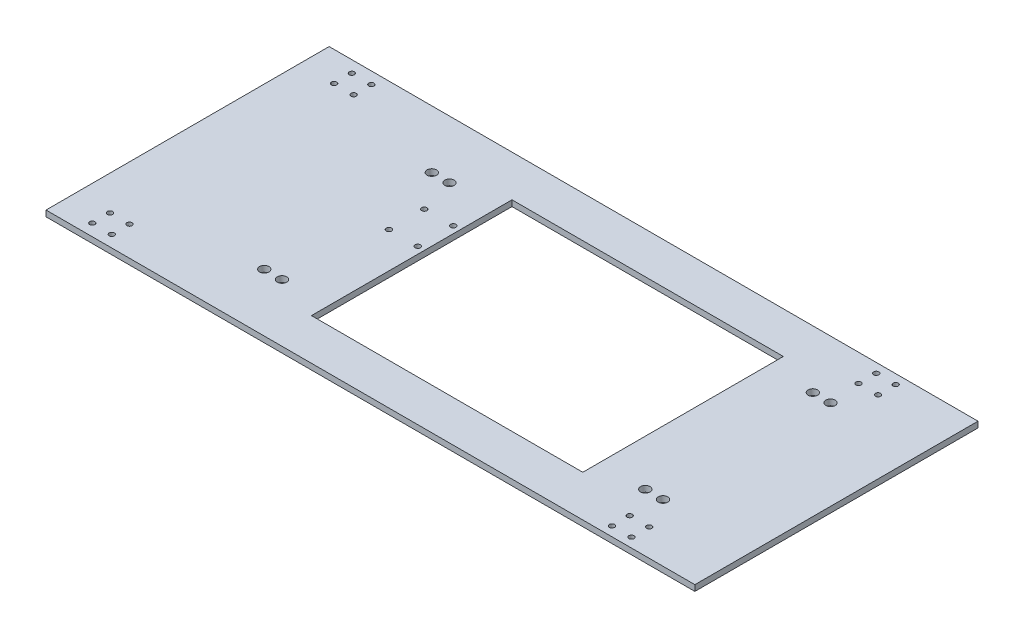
from build123d import *

# Parameters (mm, degrees)
SKETCH_1_W               = 550
SKETCH_1_H               = 240
EXTRUDE_1_DEPTH          = 31.5
SKETCH_2_W               = 105
SKETCH_2_H               = 230
CUT_EXTRUDE_1_DEPTH      = 24.5
SKETCH_3_W               = 230
SKETCH_3_H               = 170
CUT_EXTRUDE_2_DEPTH      = 302.690652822
SKETCH_4_R               = 9
EXTRUDE_2_DEPTH          = 5
SKETCH_5_R               = 6
SKETCH_5_R_2             = 4
CUT_EXTRUDE_3_DEPTH      = 10
SKETCH_6_R               = 2.2
CUT_EXTRUDE_4_DEPTH      = 10
EXTRUDE_3_DEPTH          = 31.5
HOLE_WIZARD_M10_1_D      = 8.5
HOLE_WIZARD_M10_1_DEPTH  = 31
HOLE_WIZARD_M10_1_TIP    = 2.553657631
CUT_EXTRUDE_5_DEPTH      = 10
CUT_EXTRUDE_5_DEPTH_BACK = 21.5
SKETCH_11_W              = 728.102088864
SKETCH_11_H              = 268.027352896
SKETCH_12_W              = 62.925356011
SKETCH_12_H              = 238.573797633
CUT_EXTRUDE_6_DEPTH      = 64
SKETCH_13_R              = 2.25
CUT_EXTRUDE_7_DEPTH      = 16
EXTRUDE_START            = 3
SKETCH_14_W              = 105
SKETCH_14_H              = 230
SKETCH_14_R              = 2.2
EXTRUDE_4_DEPTH          = 3
SKETCH_16_R              = 2.2
CUT_EXTRUDE_8_DEPTH      = 50
SKETCH_17_W              = 550
SKETCH_17_H              = 240
CUT_EXTRUDE_9_DEPTH      = 5
SKETCH_18_R              = 4
CUT_EXTRUDE_10_DEPTH     = 5


with BuildPart() as part:
    # Sketch 1 → Extrude 1 (new body)
    with BuildSketch(Plane(origin=(0, 0, 0), x_dir=(1, 0, 0), z_dir=(0, 1, 0))):
        Rectangle(SKETCH_1_W, SKETCH_1_H)
    extrude(amount=EXTRUDE_1_DEPTH)

    # Sketch 2 → Cut-Extrude 1 (cut)
    with BuildSketch(Plane(origin=(0, 31.5, 0), x_dir=(1, 0, 0), z_dir=(0, 1, 0))):
        with Locations((-212.5, 0)):
            Rectangle(SKETCH_2_W, SKETCH_2_H)
        with Locations((212.5, 0)):
            Rectangle(SKETCH_2_W, SKETCH_2_H)
    extrude(amount=-CUT_EXTRUDE_1_DEPTH, mode=Mode.SUBTRACT)

    # Sketch 3 → Cut-Extrude 2 (cut, through all)
    with BuildSketch(Plane(origin=(0, 31.5, 0), x_dir=(1, 0, 0), z_dir=(0, 1, 0))):
        with Locations((30, 0)):
            Rectangle(SKETCH_3_W, SKETCH_3_H)
    extrude(amount=-CUT_EXTRUDE_2_DEPTH, mode=Mode.SUBTRACT)

    # Sketch 4 → Extrude 2 (add)
    with BuildSketch(Plane.XY.offset(120)):
        with Locations((-237.5, 31.5)):
            Circle(SKETCH_4_R)
        with Locations((237.5, 31.5)):
            Circle(SKETCH_4_R)
    extrude_2 = extrude(amount=-EXTRUDE_2_DEPTH)

    # Sketch 5 → Cut-Extrude 3 (cut)
    with BuildSketch(Plane.XY.offset(120)):
        with Locations((-237.5, 31.5)):
            Circle(SKETCH_5_R)
        with Locations((237.5, 31.5)):
            Circle(SKETCH_5_R_2)
    cut_extrude_3 = extrude(amount=-CUT_EXTRUDE_3_DEPTH, mode=Mode.SUBTRACT)

    # Sketch 6 → Cut-Extrude 4 (cut)
    with BuildSketch(Plane(origin=(0, 7, 0), x_dir=(1, 0, 0), z_dir=(0, 1, 0))):
        with Locations(Location((-245.75, -95, 0), (0, 0, 270))):
            Circle(SKETCH_6_R)
        with Locations(Location((-245.75, -110, 0), (0, 0, 270))):
            Circle(SKETCH_6_R)
        with Locations(Location((-229.25, -110, 0), (0, 0, 90))):
            Circle(SKETCH_6_R)
        with Locations(Location((-229.25, -95, 0), (0, 0, 90))):
            Circle(SKETCH_6_R)
    cut_extrude_4 = extrude(amount=-CUT_EXTRUDE_4_DEPTH, mode=Mode.SUBTRACT)

    # Mirror 1: Extrude 2, Cut-Extrude 3, Cut-Extrude 4 across plane
    add(extrude_2.mirror(Plane.XY))
    add(cut_extrude_3.mirror(Plane.XY), mode=Mode.SUBTRACT)
    add(cut_extrude_4.mirror(Plane.XY), mode=Mode.SUBTRACT)

    # Sketch 7 → Extrude 3 (add)
    with BuildSketch(Plane(origin=(0, 31.5, 0), x_dir=(1, 0, 0), z_dir=(0, 1, 0))):
        Polygon((-275, 68), (-286, 68), (-286, 0), (-286, -68), (-275, -68), (-275, -78), (-296, -78), (-296, 0), (-296, 78), (-275, 78), align=None)
    extrude(amount=-EXTRUDE_3_DEPTH)

    # Hole Wizard M10 _1
    with Locations(Plane(origin=(-296, 15.75, -45), x_dir=(0, 0, -1), z_dir=(-1, 0, 0))):
        with Locations((0, 0), (-90, 0)):
            Hole(HOLE_WIZARD_M10_1_D / 2, depth=HOLE_WIZARD_M10_1_DEPTH)
            with Locations((0, 0, -(HOLE_WIZARD_M10_1_DEPTH + HOLE_WIZARD_M10_1_TIP / 2))):  # 118° drill point
                Cone(0, HOLE_WIZARD_M10_1_D / 2, HOLE_WIZARD_M10_1_TIP, mode=Mode.SUBTRACT)

    # Sketch 11 → Cut-Extrude 5 (cut, two sides: drawn at the far end of the back side and taken through both)
    with BuildSketch(Plane(origin=(0, 31.5, 0), x_dir=(1, 0, 0), z_dir=(0, 1, 0)).offset(-CUT_EXTRUDE_5_DEPTH_BACK)):
        Rectangle(SKETCH_11_W, SKETCH_11_H)
    extrude(amount=CUT_EXTRUDE_5_DEPTH + CUT_EXTRUDE_5_DEPTH_BACK, mode=Mode.SUBTRACT)

    # Sketch 12 → Cut-Extrude 6 (cut)
    with BuildSketch(Plane(origin=(0, 10, 0), x_dir=(1, 0, 0), z_dir=(0, 1, 0))):
        with Locations((-306.462678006, 14.726777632)):
            Rectangle(SKETCH_12_W, SKETCH_12_H)
    extrude(amount=-CUT_EXTRUDE_6_DEPTH, mode=Mode.SUBTRACT)

    # Sketch 13 → Cut-Extrude 7 (cut)
    with BuildSketch(Plane.XZ):
        with Locations(Location((-115.312216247, -40.980762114, 0), (0, 0, 270))):
            Circle(SKETCH_13_R)
        with Locations(Location((-115.312216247, -10.980762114, 0), (0, 0, 270))):
            Circle(SKETCH_13_R)
        with Locations(Location((-90.812216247, -40.980762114, 0), (0, 0, 270))):
            Circle(SKETCH_13_R)
        with Locations(Location((-90.812216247, -10.980762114, 0), (0, 0, 270))):
            Circle(SKETCH_13_R)
    extrude(amount=-CUT_EXTRUDE_7_DEPTH, mode=Mode.SUBTRACT)

    # Sketch 14 → Extrude 4 (add)
    # profile 1 of 2: a face of its own
    with BuildSketch(Plane(origin=(0, 7, 0), x_dir=(1, 0, 0), z_dir=(0, 1, 0)).offset(EXTRUDE_START)):
        with Locations((212.5, 0)):
            Rectangle(SKETCH_14_W, SKETCH_14_H)
    # profile 2 of 2: a face of its own
    with BuildSketch(Plane(origin=(0, 7, 0), x_dir=(1, 0, 0), z_dir=(0, 1, 0)).offset(EXTRUDE_START)):
        with Locations((-212.5, 0)):
            Rectangle(SKETCH_14_W, SKETCH_14_H)
        with Locations(Location((-229.25, -110, 0), (0, 0, 90))):
            Circle(SKETCH_14_R, mode=Mode.SUBTRACT)
        with Locations(Location((-245.75, -110, 0), (0, 0, 90))):
            Circle(SKETCH_14_R, mode=Mode.SUBTRACT)
        with Locations(Location((-245.75, -95, 0), (0, 0, 90))):
            Circle(SKETCH_14_R, mode=Mode.SUBTRACT)
        with Locations(Location((-229.25, -95, 0), (0, 0, 90))):
            Circle(SKETCH_14_R, mode=Mode.SUBTRACT)
        with Locations(Location((-245.75, 95, 0), (0, 0, 90))):
            Circle(SKETCH_14_R, mode=Mode.SUBTRACT)
        with Locations(Location((-245.75, 110, 0), (0, 0, 90))):
            Circle(SKETCH_14_R, mode=Mode.SUBTRACT)
        with Locations(Location((-229.25, 110, 0), (0, 0, 90))):
            Circle(SKETCH_14_R, mode=Mode.SUBTRACT)
        with Locations(Location((-229.25, 95, 0), (0, 0, 90))):
            Circle(SKETCH_14_R, mode=Mode.SUBTRACT)
    extrude(amount=-EXTRUDE_4_DEPTH)

    # Sketch 16 → Cut-Extrude 8 (cut)
    with BuildSketch(Plane(origin=(0, 10, 0), x_dir=(1, 0, 0), z_dir=(0, 1, 0))):
        with Locations(Location((196.75, -112, 0), (0, 0, 270))):
            Circle(SKETCH_16_R)
        with Locations(Location((196.75, -97, 0), (0, 0, 270))):
            Circle(SKETCH_16_R)
        with Locations(Location((213.25, -97, 0), (0, 0, 90))):
            Circle(SKETCH_16_R)
        with Locations(Location((213.25, -112, 0), (0, 0, 90))):
            Circle(SKETCH_16_R)
        with Locations(Location((196.75, 97, 0), (0, 0, 90))):
            Circle(SKETCH_16_R)
        with Locations(Location((196.75, 112, 0), (0, 0, 90))):
            Circle(SKETCH_16_R)
        with Locations(Location((213.25, 112, 0), (0, 0, 270))):
            Circle(SKETCH_16_R)
        with Locations(Location((213.25, 97, 0), (0, 0, 270))):
            Circle(SKETCH_16_R)
    extrude(amount=-CUT_EXTRUDE_8_DEPTH, mode=Mode.SUBTRACT)

    # Sketch 17 → Cut-Extrude 9 (cut)
    with BuildSketch(Plane(origin=(0, 10, 0), x_dir=(1, 0, 0), z_dir=(0, 1, 0))):
        Rectangle(SKETCH_17_W, SKETCH_17_H)
    extrude(amount=-CUT_EXTRUDE_9_DEPTH, mode=Mode.SUBTRACT)

    # Sketch 18 → Cut-Extrude 10 (cut)
    with BuildSketch(Plane.XZ):
        with Locations(Location((184, -71, 0), (0, 0, 270))):
            Circle(SKETCH_18_R)
        with Locations(Location((199, -71, 0), (0, 0, 270))):
            Circle(SKETCH_18_R)
        with Locations(Location((184, 71, 0), (0, 0, 270))):
            Circle(SKETCH_18_R)
        with Locations(Location((199, 71, 0), (0, 0, 270))):
            Circle(SKETCH_18_R)
        with Locations(Location((-139, 71, 0), (0, 0, 270))):
            Circle(SKETCH_18_R)
        with Locations(Location((-124, 71, 0), (0, 0, 270))):
            Circle(SKETCH_18_R)
        with Locations(Location((-124, -71, 0), (0, 0, 270))):
            Circle(SKETCH_18_R)
        with Locations(Location((-139, -71, 0), (0, 0, 270))):
            Circle(SKETCH_18_R)
    extrude(amount=-CUT_EXTRUDE_10_DEPTH, mode=Mode.SUBTRACT)


solid = part.part
